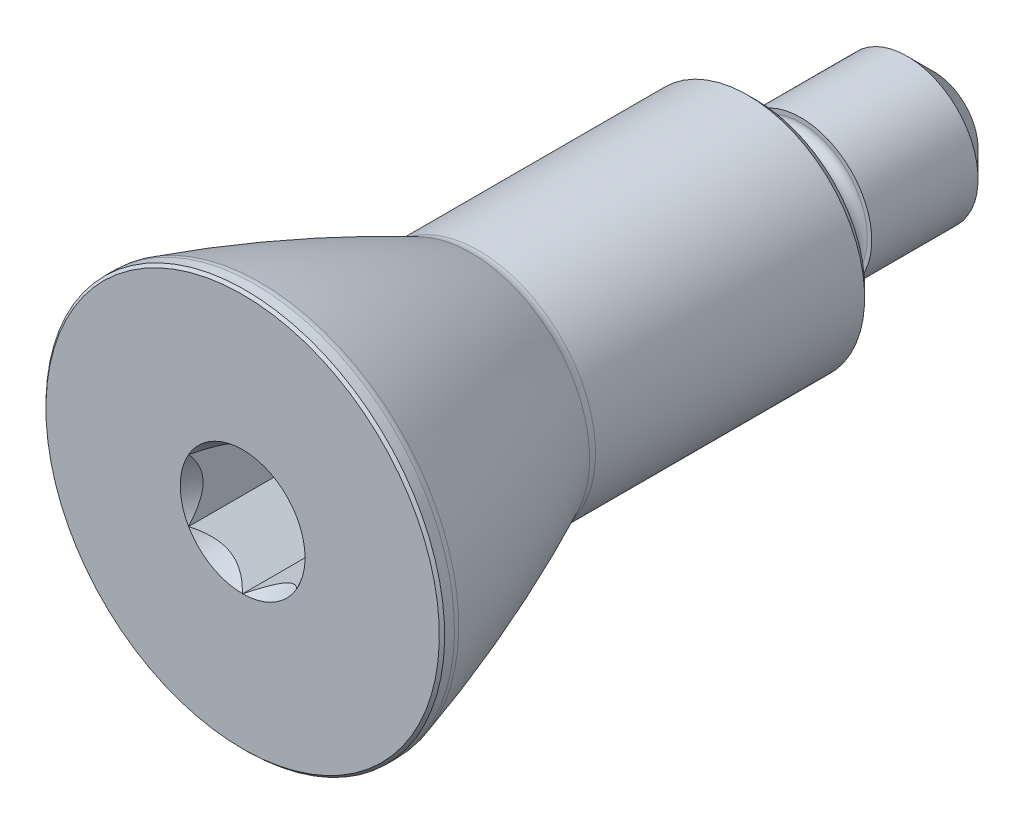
ISO-10303-21;
HEADER;
FILE_DESCRIPTION(('STEP AP214'),'2;1');
FILE_NAME('part.step','',(''),(''),'','','');
FILE_SCHEMA(('AUTOMOTIVE_DESIGN { 1 0 10303 214 1 1 1 1 }'));
ENDSEC;
DATA;
#1=APPLICATION_CONTEXT('core data for automotive mechanical design processes');
#2=APPLICATION_PROTOCOL_DEFINITION('international standard','automotive_design',2000,#1);
#3=PRODUCT_CONTEXT('',#1,'mechanical');
#4=PRODUCT('Part','Part','',(#3));
#5=PRODUCT_RELATED_PRODUCT_CATEGORY('part','',(#4));
#6=PRODUCT_DEFINITION_FORMATION('','',#4);
#7=PRODUCT_DEFINITION_CONTEXT('part definition',#1,'design');
#8=PRODUCT_DEFINITION('design','',#6,#7);
#9=PRODUCT_DEFINITION_SHAPE('','',#8);
#10=(LENGTH_UNIT() NAMED_UNIT(*) SI_UNIT(.MILLI.,.METRE.));
#11=(NAMED_UNIT(*) PLANE_ANGLE_UNIT() SI_UNIT($,.RADIAN.));
#12=(NAMED_UNIT(*) SI_UNIT($,.STERADIAN.) SOLID_ANGLE_UNIT());
#13=UNCERTAINTY_MEASURE_WITH_UNIT(LENGTH_MEASURE(1.E-05),#10,'distance_accuracy_value','');
#14=(GEOMETRIC_REPRESENTATION_CONTEXT(3) GLOBAL_UNCERTAINTY_ASSIGNED_CONTEXT((#13)) GLOBAL_UNIT_ASSIGNED_CONTEXT((#10,
#11,#12)) REPRESENTATION_CONTEXT('',''));
#15=CARTESIAN_POINT('',(0.,0.,0.));
#16=DIRECTION('',(0.,0.,1.));
#17=DIRECTION('',(1.,0.,0.));
#18=AXIS2_PLACEMENT_3D('',#15,#16,#17);
#19=CARTESIAN_POINT('',(0.,0.,29.));
#20=DIRECTION('',(0.,0.,-1.));
#21=DIRECTION('',(-0.5,0.866025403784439,0.));
#22=AXIS2_PLACEMENT_3D('',#19,#20,#21);
#23=PLANE('',#22);
#24=CARTESIAN_POINT('',(0.,0.,29.));
#25=DIRECTION('',(0.,0.,-1.));
#26=DIRECTION('',(-0.5,0.866025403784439,0.));
#27=AXIS2_PLACEMENT_3D('',#24,#25,#26);
#28=CIRCLE('',#27,11.1);
#29=CARTESIAN_POINT('',(-5.55,9.61288198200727,29.));
#30=VERTEX_POINT('',#29);
#31=EDGE_CURVE('E22',#30,#30,#28,.F.);
#32=ORIENTED_EDGE('',*,*,#31,.T.);
#33=EDGE_LOOP('',(#32));
#34=FACE_BOUND('',#33,.T.);
#35=CARTESIAN_POINT('',(0.,0.,29.));
#36=DIRECTION('',(0.,0.,-1.));
#37=DIRECTION('',(-0.5,0.866025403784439,0.));
#38=AXIS2_PLACEMENT_3D('',#35,#36,#37);
#39=CIRCLE('',#38,3.52183664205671);
#40=CARTESIAN_POINT('',(-3.05,1.76091832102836,29.));
#41=VERTEX_POINT('',#40);
#42=CARTESIAN_POINT('',(-3.05,-1.76091832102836,29.));
#43=VERTEX_POINT('',#42);
#44=EDGE_CURVE('E340',#41,#43,#39,.F.);
#45=ORIENTED_EDGE('',*,*,#44,.F.);
#46=CARTESIAN_POINT('',(0.,3.52183664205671,29.));
#47=VERTEX_POINT('',#46);
#48=EDGE_CURVE('E100',#47,#41,#39,.F.);
#49=ORIENTED_EDGE('',*,*,#48,.F.);
#50=CARTESIAN_POINT('',(3.05,1.76091832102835,29.));
#51=VERTEX_POINT('',#50);
#52=EDGE_CURVE('E337',#51,#47,#39,.F.);
#53=ORIENTED_EDGE('',*,*,#52,.F.);
#54=CARTESIAN_POINT('',(3.05,-1.76091832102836,29.));
#55=VERTEX_POINT('',#54);
#56=EDGE_CURVE('E28',#55,#51,#39,.F.);
#57=ORIENTED_EDGE('',*,*,#56,.F.);
#58=CARTESIAN_POINT('',(0.,-3.52183664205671,29.));
#59=VERTEX_POINT('',#58);
#60=EDGE_CURVE('E35',#59,#55,#39,.F.);
#61=ORIENTED_EDGE('',*,*,#60,.F.);
#62=EDGE_CURVE('E348',#43,#59,#39,.F.);
#63=ORIENTED_EDGE('',*,*,#62,.F.);
#64=EDGE_LOOP('',(#45,#49,#53,#57,#61,#63));
#65=FACE_BOUND('',#64,.T.);
#66=ADVANCED_FACE('F14',(#34,#65),#23,.F.);
#67=CARTESIAN_POINT('',(0.,0.,-10.));
#68=DIRECTION('',(0.,0.,1.));
#69=DIRECTION('',(0.5,-0.866025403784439,0.));
#70=AXIS2_PLACEMENT_3D('',#67,#68,#69);
#71=PLANE('',#70);
#72=CARTESIAN_POINT('',(0.,0.,-10.));
#73=DIRECTION('',(0.,0.,1.));
#74=DIRECTION('',(0.5,-0.866025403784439,0.));
#75=AXIS2_PLACEMENT_3D('',#72,#73,#74);
#76=CIRCLE('',#75,2.5);
#77=CARTESIAN_POINT('',(1.25,-2.1650635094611,-10.));
#78=VERTEX_POINT('',#77);
#79=EDGE_CURVE('E162',#78,#78,#76,.F.);
#80=ORIENTED_EDGE('',*,*,#79,.T.);
#81=EDGE_LOOP('',(#80));
#82=FACE_BOUND('',#81,.T.);
#83=ADVANCED_FACE('F243',(#82),#71,.F.);
#84=CARTESIAN_POINT('',(0.,0.,40.2674973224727));
#85=DIRECTION('',(0.,0.,1.));
#86=DIRECTION('',(0.5,-0.866025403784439,0.));
#87=AXIS2_PLACEMENT_3D('',#84,#85,#86);
#88=CYLINDRICAL_SURFACE('',#87,4.);
#89=CARTESIAN_POINT('',(0.,0.,-8.5));
#90=DIRECTION('',(0.,0.,1.));
#91=DIRECTION('',(0.5,-0.866025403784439,0.));
#92=AXIS2_PLACEMENT_3D('',#89,#90,#91);
#93=CIRCLE('',#92,4.);
#94=CARTESIAN_POINT('',(2.,-3.46410161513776,-8.5));
#95=VERTEX_POINT('',#94);
#96=EDGE_CURVE('E159',#95,#95,#93,.T.);
#97=ORIENTED_EDGE('',*,*,#96,.T.);
#98=EDGE_LOOP('',(#97));
#99=FACE_BOUND('',#98,.T.);
#100=CARTESIAN_POINT('',(0.,0.,-2.5));
#101=DIRECTION('',(0.,0.,1.));
#102=DIRECTION('',(0.5,-0.866025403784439,0.));
#103=AXIS2_PLACEMENT_3D('',#100,#101,#102);
#104=CIRCLE('',#103,4.);
#105=CARTESIAN_POINT('',(2.,-3.46410161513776,-2.5));
#106=VERTEX_POINT('',#105);
#107=EDGE_CURVE('E150',#106,#106,#104,.T.);
#108=ORIENTED_EDGE('',*,*,#107,.F.);
#109=EDGE_LOOP('',(#108));
#110=FACE_BOUND('',#109,.T.);
#111=ADVANCED_FACE('F250',(#99,#110),#88,.T.);
#112=CARTESIAN_POINT('',(3.24759526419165,1.875,-2.5));
#113=DIRECTION('',(0.,0.,-1.));
#114=DIRECTION('',(-0.5,0.866025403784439,0.));
#115=AXIS2_PLACEMENT_3D('',#112,#113,#114);
#116=PLANE('',#115);
#117=CARTESIAN_POINT('',(0.,0.,-2.5));
#118=DIRECTION('',(0.,0.,1.));
#119=DIRECTION('',(0.5,-0.866025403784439,0.));
#120=AXIS2_PLACEMENT_3D('',#117,#118,#119);
#121=CIRCLE('',#120,3.75);
#122=CARTESIAN_POINT('',(1.875,-3.24759526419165,-2.5));
#123=VERTEX_POINT('',#122);
#124=EDGE_CURVE('E147',#123,#123,#121,.T.);
#125=ORIENTED_EDGE('',*,*,#124,.F.);
#126=EDGE_LOOP('',(#125));
#127=FACE_BOUND('',#126,.T.);
#128=ORIENTED_EDGE('',*,*,#107,.T.);
#129=EDGE_LOOP('',(#128));
#130=FACE_BOUND('',#129,.T.);
#131=ADVANCED_FACE('F295',(#127,#130),#116,.F.);
#132=CARTESIAN_POINT('',(0.,0.,-2.));
#133=DIRECTION('',(0.,0.,1.));
#134=DIRECTION('',(0.5,-0.866025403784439,0.));
#135=AXIS2_PLACEMENT_3D('',#132,#133,#134);
#136=TOROIDAL_SURFACE('',#135,3.75,0.5);
#137=CARTESIAN_POINT('',(0.,0.,-2.));
#138=DIRECTION('',(0.,0.,1.));
#139=DIRECTION('',(0.5,-0.866025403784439,0.));
#140=AXIS2_PLACEMENT_3D('',#137,#138,#139);
#141=CIRCLE('',#140,3.25);
#142=CARTESIAN_POINT('',(1.625,-2.81458256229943,-2.));
#143=VERTEX_POINT('',#142);
#144=EDGE_CURVE('E144',#143,#143,#141,.T.);
#145=ORIENTED_EDGE('',*,*,#144,.F.);
#146=EDGE_LOOP('',(#145));
#147=FACE_BOUND('',#146,.T.);
#148=ORIENTED_EDGE('',*,*,#124,.T.);
#149=EDGE_LOOP('',(#148));
#150=FACE_BOUND('',#149,.T.);
#151=ADVANCED_FACE('F291',(#147,#150),#136,.F.);
#152=CARTESIAN_POINT('',(0.,0.,40.2674973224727));
#153=DIRECTION('',(0.,0.,1.));
#154=DIRECTION('',(0.5,-0.866025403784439,0.));
#155=AXIS2_PLACEMENT_3D('',#152,#153,#154);
#156=CYLINDRICAL_SURFACE('',#155,3.25);
#157=CARTESIAN_POINT('',(0.,0.,-0.5));
#158=DIRECTION('',(0.,0.,1.));
#159=DIRECTION('',(0.5,-0.866025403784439,0.));
#160=AXIS2_PLACEMENT_3D('',#157,#158,#159);
#161=CIRCLE('',#160,3.25);
#162=CARTESIAN_POINT('',(1.625,-2.81458256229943,-0.5));
#163=VERTEX_POINT('',#162);
#164=EDGE_CURVE('E141',#163,#163,#161,.T.);
#165=ORIENTED_EDGE('',*,*,#164,.F.);
#166=EDGE_LOOP('',(#165));
#167=FACE_BOUND('',#166,.T.);
#168=ORIENTED_EDGE('',*,*,#144,.T.);
#169=EDGE_LOOP('',(#168));
#170=FACE_BOUND('',#169,.T.);
#171=ADVANCED_FACE('F287',(#167,#170),#156,.T.);
#172=CARTESIAN_POINT('',(0.,0.,-0.5));
#173=DIRECTION('',(0.,0.,1.));
#174=DIRECTION('',(0.5,-0.866025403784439,0.));
#175=AXIS2_PLACEMENT_3D('',#172,#173,#174);
#176=TOROIDAL_SURFACE('',#175,3.75,0.5);
#177=CARTESIAN_POINT('',(0.,0.,0.));
#178=DIRECTION('',(0.,0.,1.));
#179=DIRECTION('',(0.5,-0.866025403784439,0.));
#180=AXIS2_PLACEMENT_3D('',#177,#178,#179);
#181=CIRCLE('',#180,3.75);
#182=CARTESIAN_POINT('',(1.875,-3.24759526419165,0.));
#183=VERTEX_POINT('',#182);
#184=EDGE_CURVE('E138',#183,#183,#181,.T.);
#185=ORIENTED_EDGE('',*,*,#184,.F.);
#186=EDGE_LOOP('',(#185));
#187=FACE_BOUND('',#186,.T.);
#188=ORIENTED_EDGE('',*,*,#164,.T.);
#189=EDGE_LOOP('',(#188));
#190=FACE_BOUND('',#189,.T.);
#191=ADVANCED_FACE('F283',(#187,#190),#176,.F.);
#192=CARTESIAN_POINT('',(3.24759526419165,1.875,0.));
#193=DIRECTION('',(0.,0.,1.));
#194=DIRECTION('',(0.5,-0.866025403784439,0.));
#195=AXIS2_PLACEMENT_3D('',#192,#193,#194);
#196=PLANE('',#195);
#197=CARTESIAN_POINT('',(0.,0.,0.));
#198=DIRECTION('',(0.,0.,1.));
#199=DIRECTION('',(0.5,-0.866025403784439,0.));
#200=AXIS2_PLACEMENT_3D('',#197,#198,#199);
#201=CIRCLE('',#200,6.1);
#202=CARTESIAN_POINT('',(3.05,-5.28275496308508,0.));
#203=VERTEX_POINT('',#202);
#204=EDGE_CURVE('E156',#203,#203,#201,.F.);
#205=ORIENTED_EDGE('',*,*,#204,.T.);
#206=EDGE_LOOP('',(#205));
#207=FACE_BOUND('',#206,.T.);
#208=ORIENTED_EDGE('',*,*,#184,.T.);
#209=EDGE_LOOP('',(#208));
#210=FACE_BOUND('',#209,.T.);
#211=ADVANCED_FACE('F279',(#207,#210),#196,.F.);
#212=CARTESIAN_POINT('',(0.,0.,40.2674973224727));
#213=DIRECTION('',(0.,0.,1.));
#214=DIRECTION('',(0.5,-0.866025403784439,0.));
#215=AXIS2_PLACEMENT_3D('',#212,#213,#214);
#216=CYLINDRICAL_SURFACE('',#215,6.6);
#217=CARTESIAN_POINT('',(0.,0.,0.500000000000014));
#218=DIRECTION('',(0.,0.,1.));
#219=DIRECTION('',(0.5,-0.866025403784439,0.));
#220=AXIS2_PLACEMENT_3D('',#217,#218,#219);
#221=CIRCLE('',#220,6.6);
#222=CARTESIAN_POINT('',(3.3,-5.7157676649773,0.500000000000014));
#223=VERTEX_POINT('',#222);
#224=EDGE_CURVE('E153',#223,#223,#221,.T.);
#225=ORIENTED_EDGE('',*,*,#224,.T.);
#226=EDGE_LOOP('',(#225));
#227=FACE_BOUND('',#226,.T.);
#228=CARTESIAN_POINT('',(0.,0.,15.6872780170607));
#229=DIRECTION('',(0.,0.,1.));
#230=DIRECTION('',(0.5,-0.866025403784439,0.));
#231=AXIS2_PLACEMENT_3D('',#228,#229,#230);
#232=CIRCLE('',#231,6.6);
#233=CARTESIAN_POINT('',(3.3,-5.7157676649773,15.6872780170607));
#234=VERTEX_POINT('',#233);
#235=EDGE_CURVE('E135',#234,#234,#232,.T.);
#236=ORIENTED_EDGE('',*,*,#235,.F.);
#237=EDGE_LOOP('',(#236));
#238=FACE_BOUND('',#237,.T.);
#239=ADVANCED_FACE('F275',(#227,#238),#216,.T.);
#240=CARTESIAN_POINT('',(0.,0.,15.6872780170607));
#241=DIRECTION('',(0.,0.,1.));
#242=DIRECTION('',(0.5,-0.866025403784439,0.));
#243=AXIS2_PLACEMENT_3D('',#240,#241,#242);
#244=TOROIDAL_SURFACE('',#243,7.6,1.);
#245=CARTESIAN_POINT('',(0.,0.,16.1139968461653));
#246=DIRECTION('',(0.,0.,1.));
#247=DIRECTION('',(0.5,-0.866025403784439,0.));
#248=AXIS2_PLACEMENT_3D('',#245,#246,#247);
#249=CIRCLE('',#248,6.69561565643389);
#250=CARTESIAN_POINT('',(3.34780782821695,-5.79857325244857,16.1139968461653));
#251=VERTEX_POINT('',#250);
#252=EDGE_CURVE('E132',#251,#251,#249,.T.);
#253=ORIENTED_EDGE('',*,*,#252,.F.);
#254=EDGE_LOOP('',(#253));
#255=FACE_BOUND('',#254,.T.);
#256=ORIENTED_EDGE('',*,*,#235,.T.);
#257=EDGE_LOOP('',(#256));
#258=FACE_BOUND('',#257,.T.);
#259=ADVANCED_FACE('F271',(#255,#258),#244,.F.);
#260=CARTESIAN_POINT('',(0.,0.,50.8062376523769));
#261=DIRECTION('',(0.,0.,1.));
#262=DIRECTION('',(0.5,-0.866025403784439,0.));
#263=AXIS2_PLACEMENT_3D('',#260,#261,#262);
#264=DEGENERATE_TOROIDAL_SURFACE('',#263,66.8308314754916,81.3,.F.);
#265=CARTESIAN_POINT('',(0.,0.,28.0173685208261));
#266=DIRECTION('',(0.,0.,1.));
#267=DIRECTION('',(0.5,-0.866025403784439,0.));
#268=AXIS2_PLACEMENT_3D('',#265,#266,#267);
#269=CIRCLE('',#268,11.2099107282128);
#270=CARTESIAN_POINT('',(5.60495536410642,-9.70806746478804,28.0173685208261));
#271=VERTEX_POINT('',#270);
#272=EDGE_CURVE('E129',#271,#271,#269,.T.);
#273=ORIENTED_EDGE('',*,*,#272,.F.);
#274=EDGE_LOOP('',(#273));
#275=FACE_BOUND('',#274,.T.);
#276=ORIENTED_EDGE('',*,*,#252,.T.);
#277=EDGE_LOOP('',(#276));
#278=FACE_BOUND('',#277,.T.);
#279=ADVANCED_FACE('F267',(#275,#278),#264,.F.);
#280=CARTESIAN_POINT('',(0.,0.,28.297674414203));
#281=DIRECTION('',(0.,0.,1.));
#282=DIRECTION('',(0.5,-0.866025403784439,0.));
#283=AXIS2_PLACEMENT_3D('',#280,#281,#282);
#284=TOROIDAL_SURFACE('',#283,10.25,1.);
#285=CARTESIAN_POINT('',(0.,0.,28.297674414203));
#286=DIRECTION('',(0.,0.,1.));
#287=DIRECTION('',(0.5,-0.866025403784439,0.));
#288=AXIS2_PLACEMENT_3D('',#285,#286,#287);
#289=CIRCLE('',#288,11.25);
#290=CARTESIAN_POINT('',(5.625,-9.74278579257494,28.297674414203));
#291=VERTEX_POINT('',#290);
#292=EDGE_CURVE('E126',#291,#291,#289,.T.);
#293=ORIENTED_EDGE('',*,*,#292,.F.);
#294=EDGE_LOOP('',(#293));
#295=FACE_BOUND('',#294,.T.);
#296=ORIENTED_EDGE('',*,*,#272,.T.);
#297=EDGE_LOOP('',(#296));
#298=FACE_BOUND('',#297,.T.);
#299=ADVANCED_FACE('F263',(#295,#298),#284,.T.);
#300=CARTESIAN_POINT('',(0.,0.,40.2674973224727));
#301=DIRECTION('',(0.,0.,1.));
#302=DIRECTION('',(0.5,-0.866025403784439,0.));
#303=AXIS2_PLACEMENT_3D('',#300,#301,#302);
#304=CYLINDRICAL_SURFACE('',#303,11.25);
#305=CARTESIAN_POINT('',(0.,0.,28.85));
#306=DIRECTION('',(0.,0.,-1.));
#307=DIRECTION('',(-0.5,0.866025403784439,0.));
#308=AXIS2_PLACEMENT_3D('',#305,#306,#307);
#309=CIRCLE('',#308,11.25);
#310=CARTESIAN_POINT('',(-5.625,9.74278579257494,28.85));
#311=VERTEX_POINT('',#310);
#312=EDGE_CURVE('E9',#311,#311,#309,.T.);
#313=ORIENTED_EDGE('',*,*,#312,.T.);
#314=EDGE_LOOP('',(#313));
#315=FACE_BOUND('',#314,.T.);
#316=ORIENTED_EDGE('',*,*,#292,.T.);
#317=EDGE_LOOP('',(#316));
#318=FACE_BOUND('',#317,.T.);
#319=ADVANCED_FACE('F259',(#315,#318),#304,.T.);
#320=CARTESIAN_POINT('',(0.,0.,0.500000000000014));
#321=DIRECTION('',(0.,0.,1.));
#322=DIRECTION('',(0.5,-0.866025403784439,0.));
#323=AXIS2_PLACEMENT_3D('',#320,#321,#322);
#324=CONICAL_SURFACE('',#323,6.6,0.785398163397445);
#325=ORIENTED_EDGE('',*,*,#204,.F.);
#326=EDGE_LOOP('',(#325));
#327=FACE_BOUND('',#326,.T.);
#328=ORIENTED_EDGE('',*,*,#224,.F.);
#329=EDGE_LOOP('',(#328));
#330=FACE_BOUND('',#329,.T.);
#331=ADVANCED_FACE('F262',(#327,#330),#324,.T.);
#332=CARTESIAN_POINT('',(0.,0.,-8.5));
#333=DIRECTION('',(0.,0.,1.));
#334=DIRECTION('',(0.5,-0.866025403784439,0.));
#335=AXIS2_PLACEMENT_3D('',#332,#333,#334);
#336=CONICAL_SURFACE('',#335,4.,0.785398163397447);
#337=ORIENTED_EDGE('',*,*,#79,.F.);
#338=EDGE_LOOP('',(#337));
#339=FACE_BOUND('',#338,.T.);
#340=ORIENTED_EDGE('',*,*,#96,.F.);
#341=EDGE_LOOP('',(#340));
#342=FACE_BOUND('',#341,.T.);
#343=ADVANCED_FACE('F304',(#339,#342),#336,.T.);
#344=CARTESIAN_POINT('',(0.,0.,22.9));
#345=DIRECTION('',(0.,0.,1.));
#346=DIRECTION('',(0.5,-0.866025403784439,0.));
#347=AXIS2_PLACEMENT_3D('',#344,#345,#346);
#348=CONICAL_SURFACE('',#347,0.,0.523598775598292);
#349=ORIENTED_EDGE('',*,*,#48,.T.);
#350=CARTESIAN_POINT('',(-6.04133140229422,0.0338723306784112,33.3640574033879));
#351=CARTESIAN_POINT('',(-5.95843222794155,0.0817341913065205,33.2209537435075));
#352=CARTESIAN_POINT('',(-5.8751417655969,0.129821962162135,33.0781501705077));
#353=CARTESIAN_POINT('',(-5.70761821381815,0.226541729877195,32.7932715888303));
#354=CARTESIAN_POINT('',(-5.62338507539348,0.275173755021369,32.6511966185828));
#355=CARTESIAN_POINT('',(-5.45365369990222,0.37316821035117,32.3676328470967));
#356=CARTESIAN_POINT('',(-5.36815325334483,0.422531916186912,32.226145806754));
#357=CARTESIAN_POINT('',(-5.19584937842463,0.522011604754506,31.9442363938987));
#358=CARTESIAN_POINT('',(-5.10904597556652,0.572127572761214,31.8038140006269));
#359=CARTESIAN_POINT('',(-4.92948368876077,0.675797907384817,31.5172635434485));
#360=CARTESIAN_POINT('',(-4.83664444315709,0.729398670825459,31.3712024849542));
#361=CARTESIAN_POINT('',(-4.64885473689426,0.837819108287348,31.0809024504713));
#362=CARTESIAN_POINT('',(-4.55390433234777,0.892638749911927,30.936663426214));
#363=CARTESIAN_POINT('',(-4.36145849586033,1.00374740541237,30.6506708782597));
#364=CARTESIAN_POINT('',(-4.2639654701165,1.06003503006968,30.5089152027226));
#365=CARTESIAN_POINT('',(-4.06565909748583,1.17452726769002,30.2285458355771));
#366=CARTESIAN_POINT('',(-3.96484616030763,1.23273164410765,30.0899317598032));
#367=CARTESIAN_POINT('',(-3.76697858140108,1.34697054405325,29.8277092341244));
#368=CARTESIAN_POINT('',(-3.67024836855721,1.40281775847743,29.7037760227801));
#369=CARTESIAN_POINT('',(-3.47196380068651,1.51729740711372,29.460908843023));
#370=CARTESIAN_POINT('',(-3.37040541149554,1.5759321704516,29.3419792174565));
#371=CARTESIAN_POINT('',(-3.1623300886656,1.69606451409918,29.1129717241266));
#372=CARTESIAN_POINT('',(-3.05588743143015,1.75751921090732,29.0028046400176));
#373=CARTESIAN_POINT('',(-2.83512425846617,1.88497688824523,28.7936694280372));
#374=CARTESIAN_POINT('',(-2.7208193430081,1.95097086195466,28.6946800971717));
#375=CARTESIAN_POINT('',(-2.54985503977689,2.04967714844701,28.5656668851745));
#376=CARTESIAN_POINT('',(-2.49730800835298,2.08001519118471,28.5283934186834));
#377=CARTESIAN_POINT('',(-2.39005818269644,2.14193590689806,28.4579222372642));
#378=CARTESIAN_POINT('',(-2.33535135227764,2.17352091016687,28.4247326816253));
#379=CARTESIAN_POINT('',(-2.19233592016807,2.2560909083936,28.3461642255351));
#380=CARTESIAN_POINT('',(-2.10246225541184,2.30797949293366,28.3044539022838));
#381=CARTESIAN_POINT('',(-1.91805345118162,2.41444796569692,28.2378736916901));
#382=CARTESIAN_POINT('',(-1.82352428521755,2.46902440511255,28.212982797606));
#383=CARTESIAN_POINT('',(-1.67955559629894,2.55214476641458,28.1909039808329));
#384=CARTESIAN_POINT('',(-1.63094462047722,2.58021032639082,28.1861028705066));
#385=CARTESIAN_POINT('',(-1.53353820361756,2.63644794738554,28.1818877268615));
#386=CARTESIAN_POINT('',(-1.48474276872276,2.66462000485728,28.1824735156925));
#387=CARTESIAN_POINT('',(-1.38745951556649,2.72078651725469,28.1890187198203));
#388=CARTESIAN_POINT('',(-1.33897150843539,2.7487810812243,28.194974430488));
#389=CARTESIAN_POINT('',(-1.24265944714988,2.8043868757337,28.2119798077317));
#390=CARTESIAN_POINT('',(-1.19483581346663,2.83199786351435,28.2230325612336));
#391=CARTESIAN_POINT('',(-1.03489994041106,2.92433688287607,28.2683117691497));
#392=CARTESIAN_POINT('',(-0.925025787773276,2.98777275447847,28.3134819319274));
#393=CARTESIAN_POINT('',(-0.765979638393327,3.07959809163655,28.3955673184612));
#394=CARTESIAN_POINT('',(-0.713817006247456,3.10971420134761,28.4253988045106));
#395=CARTESIAN_POINT('',(-0.611322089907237,3.16888966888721,28.4890323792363));
#396=CARTESIAN_POINT('',(-0.560989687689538,3.19794909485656,28.5228342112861));
#397=CARTESIAN_POINT('',(-0.448434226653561,3.26293302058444,28.6034687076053));
#398=CARTESIAN_POINT('',(-0.386765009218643,3.2985377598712,28.6513224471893));
#399=CARTESIAN_POINT('',(-0.265967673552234,3.36828013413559,28.7511584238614));
#400=CARTESIAN_POINT('',(-0.206840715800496,3.40241709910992,28.8031425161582));
#401=CARTESIAN_POINT('',(-0.0907446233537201,3.46944520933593,28.9104273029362));
#402=CARTESIAN_POINT('',(-0.0337791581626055,3.50233423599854,28.9657332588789));
#403=CARTESIAN_POINT('',(0.0781973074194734,3.56698387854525,29.0789265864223));
#404=CARTESIAN_POINT('',(0.133208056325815,3.59874434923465,29.1368142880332));
#405=CARTESIAN_POINT('',(0.242227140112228,3.66168654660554,29.2554223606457));
#406=CARTESIAN_POINT('',(0.296213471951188,3.69285556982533,29.3161695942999));
#407=CARTESIAN_POINT('',(0.402678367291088,3.75432310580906,29.4393990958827));
#408=CARTESIAN_POINT('',(0.455156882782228,3.78462159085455,29.5018814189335));
#409=CARTESIAN_POINT('',(0.55874466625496,3.84442802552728,29.6282042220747));
#410=CARTESIAN_POINT('',(0.609855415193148,3.87393683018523,29.6920430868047));
#411=CARTESIAN_POINT('',(0.710931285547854,3.93229301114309,29.8209108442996));
#412=CARTESIAN_POINT('',(0.760896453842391,3.96114041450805,29.8859396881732));
#413=CARTESIAN_POINT('',(0.926335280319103,4.0566565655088,30.1050917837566));
#414=CARTESIAN_POINT('',(1.03957532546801,4.12203573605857,30.2614651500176));
#415=CARTESIAN_POINT('',(1.26198259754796,4.25044263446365,30.5780391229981));
#416=CARTESIAN_POINT('',(1.37114904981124,4.31346991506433,30.7382404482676));
#417=CARTESIAN_POINT('',(1.58639535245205,4.43774242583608,31.0615207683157));
#418=CARTESIAN_POINT('',(1.69247342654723,4.49898663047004,31.2246013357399));
#419=CARTESIAN_POINT('',(1.90215907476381,4.62004869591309,31.5528709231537));
#420=CARTESIAN_POINT('',(2.00576653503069,4.67986649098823,31.718060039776));
#421=CARTESIAN_POINT('',(2.21129719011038,4.79852967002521,32.0505476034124));
#422=CARTESIAN_POINT('',(2.31321465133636,4.85737174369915,32.2178507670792));
#423=CARTESIAN_POINT('',(2.51542774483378,4.97411952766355,32.5537602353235));
#424=CARTESIAN_POINT('',(2.61572335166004,5.03202522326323,32.7223665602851));
#425=CARTESIAN_POINT('',(2.91454728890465,5.20455130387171,33.229626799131));
#426=CARTESIAN_POINT('',(3.11108660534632,5.31802333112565,33.5698426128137));
#427=CARTESIAN_POINT('',(3.47743013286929,5.52953186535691,34.2127293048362));
#428=CARTESIAN_POINT('',(3.64764934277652,5.6278079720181,34.5150865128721));
#429=CARTESIAN_POINT('',(3.98588805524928,5.8230901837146,35.1214796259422));
#430=CARTESIAN_POINT('',(4.15390733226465,5.92009615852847,35.4255156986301));
#431=CARTESIAN_POINT('',(4.48730800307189,6.11258512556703,36.0331682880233));
#432=CARTESIAN_POINT('',(4.65269882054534,6.20807355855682,36.3367779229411));
#433=CARTESIAN_POINT('',(4.98208805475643,6.39824652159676,36.9449482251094));
#434=CARTESIAN_POINT('',(5.14608664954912,6.49293115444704,37.2495087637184));
#435=CARTESIAN_POINT('',(5.309564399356,6.58731507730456,37.5544389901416));
#436=B_SPLINE_CURVE_WITH_KNOTS('',3,(#350,#351,#352,#353,#354,#355,#356,#357,#358,#359,#360,
#361,#362,#363,#364,#365,#366,#367,#368,#369,#370,#371,#372,#373,#374,#375,#376,#377,#378,#379,
#380,#381,#382,#383,#384,#385,#386,#387,#388,#389,#390,#391,#392,#393,#394,#395,#396,#397,#398,
#399,#400,#401,#402,#403,#404,#405,#406,#407,#408,#409,#410,#411,#412,#413,#414,#415,#416,#417,
#418,#419,#420,#421,#422,#423,#424,#425,#426,#427,#428,#429,#430,#431,#432,#433,#434,#435),
.UNSPECIFIED.,.F.,.F.,(4,2,2,2,2,2,2,2,2,2,2,2,2,2,2,2,2,2,2,2,2,2,2,2,2,2,2,2,2,2,2,2,2,2,2,2,
2,2,2,2,2,2,4),(0.,0.516504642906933,1.03303625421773,1.55060997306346,2.06817357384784,
2.6116917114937,3.15519542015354,3.69820222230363,4.24114226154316,4.7415416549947,
5.24236676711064,5.73717185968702,6.23102200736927,6.44451918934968,6.65843622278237,
6.99288293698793,7.32691116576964,7.49569251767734,7.66446829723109,7.83312772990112,
8.00188944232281,8.40324541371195,8.60481008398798,8.80636173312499,9.06356118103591,
9.32087681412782,9.57861134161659,9.8363789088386,10.0974628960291,10.3585551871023,
10.619352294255,10.8801387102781,11.4915097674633,12.1029965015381,12.7148282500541,
13.3266881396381,13.9403164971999,14.5539544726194,15.7807872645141,16.8626586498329,
17.9446400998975,19.0206735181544,20.0965671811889),.UNSPECIFIED.);
#437=EDGE_CURVE('E165',#41,#47,#436,.T.);
#438=ORIENTED_EDGE('',*,*,#437,.T.);
#439=EDGE_LOOP('',(#349,#438));
#440=FACE_BOUND('',#439,.T.);
#441=ADVANCED_FACE('F183',(#440),#348,.F.);
#442=ORIENTED_EDGE('',*,*,#44,.T.);
#443=CARTESIAN_POINT('',(-3.05,-1.76114924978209,29.0002000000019));
#444=CARTESIAN_POINT('',(-3.05,-1.68746763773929,28.9364601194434));
#445=CARTESIAN_POINT('',(-3.05,-1.61231240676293,28.8742993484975));
#446=CARTESIAN_POINT('',(-3.05,-1.4581051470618,28.7541573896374));
#447=CARTESIAN_POINT('',(-3.05,-1.3790345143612,28.6962001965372));
#448=CARTESIAN_POINT('',(-3.05,-1.21472357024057,28.584772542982));
#449=CARTESIAN_POINT('',(-3.05,-1.1293766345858,28.5314567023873));
#450=CARTESIAN_POINT('',(-3.05,-0.954102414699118,28.4333386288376));
#451=CARTESIAN_POINT('',(-3.05,-0.86418582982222,28.3885175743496));
#452=CARTESIAN_POINT('',(-3.05,-0.671348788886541,28.3065926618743));
#453=CARTESIAN_POINT('',(-3.05,-0.567979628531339,28.2705112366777));
#454=CARTESIAN_POINT('',(-3.05,-0.357444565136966,28.215892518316));
#455=CARTESIAN_POINT('',(-3.05,-0.250316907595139,28.1972132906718));
#456=CARTESIAN_POINT('',(-3.05,-0.0333983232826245,28.1797183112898));
#457=CARTESIAN_POINT('',(-3.05,0.0764078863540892,28.1810825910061));
#458=CARTESIAN_POINT('',(-3.05,0.294091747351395,28.2038977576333));
#459=CARTESIAN_POINT('',(-3.05,0.401963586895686,28.2254013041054));
#460=CARTESIAN_POINT('',(-3.05,0.643232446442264,28.2939519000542));
#461=CARTESIAN_POINT('',(-3.05,0.774994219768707,28.3465858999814));
#462=CARTESIAN_POINT('',(-3.05,1.02920242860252,28.4713709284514));
#463=CARTESIAN_POINT('',(-3.05,1.15160171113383,28.5436133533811));
#464=CARTESIAN_POINT('',(-3.05,1.35624095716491,28.6798390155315));
#465=CARTESIAN_POINT('',(-3.05,1.44049164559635,28.740894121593));
#466=CARTESIAN_POINT('',(-3.05,1.60405732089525,28.8674854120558));
#467=CARTESIAN_POINT('',(-3.05,1.68341739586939,28.9329630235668));
#468=CARTESIAN_POINT('',(-3.05,1.76114924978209,29.0002000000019));
#469=B_SPLINE_CURVE_WITH_KNOTS('',3,(#443,#444,#445,#446,#447,#448,#449,#450,#451,#452,#453,
#454,#455,#456,#457,#458,#459,#460,#461,#462,#463,#464,#465,#466,#467,#468),.UNSPECIFIED.,.F.,
.F.,(4,2,2,2,2,2,2,2,2,2,2,2,4),(0.,0.292374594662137,0.586304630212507,0.887829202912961,
1.18867768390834,1.51592801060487,1.84048525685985,2.16795945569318,2.49629232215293,
2.91953531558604,3.34478599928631,3.65673008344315,3.96514171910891),.UNSPECIFIED.);
#470=EDGE_CURVE('E190',#43,#41,#469,.T.);
#471=ORIENTED_EDGE('',*,*,#470,.T.);
#472=EDGE_LOOP('',(#442,#471));
#473=FACE_BOUND('',#472,.T.);
#474=ADVANCED_FACE('F312',(#473),#348,.F.);
#475=ORIENTED_EDGE('',*,*,#62,.T.);
#476=CARTESIAN_POINT('',(0.000199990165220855,-3.52195210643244,29.0002));
#477=CARTESIAN_POINT('',(-0.0636101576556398,-3.48511130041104,28.9364601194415));
#478=CARTESIAN_POINT('',(-0.12869649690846,-3.44753368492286,28.8742993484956));
#479=CARTESIAN_POINT('',(-0.262243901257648,-3.37043005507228,28.7541573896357));
#480=CARTESIAN_POINT('',(-0.330721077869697,-3.33089473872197,28.6962001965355));
#481=CARTESIAN_POINT('',(-0.473018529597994,-3.24873926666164,28.5847725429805));
#482=CARTESIAN_POINT('',(-0.546931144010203,-3.20606579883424,28.5314567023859));
#483=CARTESIAN_POINT('',(-0.698723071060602,-3.11842868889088,28.4333386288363));
#484=CARTESIAN_POINT('',(-0.776593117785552,-3.07347039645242,28.3885175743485));
#485=CARTESIAN_POINT('',(-0.943594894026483,-2.97705187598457,28.3065926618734));
#486=CARTESIAN_POINT('',(-1.03311521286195,-2.92536729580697,28.270511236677));
#487=CARTESIAN_POINT('',(-1.21544392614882,-2.8200997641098,28.2158925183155));
#488=CARTESIAN_POINT('',(-1.30821919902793,-2.7665359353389,28.1972132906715));
#489=CARTESIAN_POINT('',(-1.49607620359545,-2.65807664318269,28.1797183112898));
#490=CARTESIAN_POINT('',(-1.59117117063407,-2.60317353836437,28.1810825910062));
#491=CARTESIAN_POINT('',(-1.77969092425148,-2.49433160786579,28.2038977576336));
#492=CARTESIAN_POINT('',(-1.87311067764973,-2.44039568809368,28.2254013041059));
#493=CARTESIAN_POINT('',(-2.08205563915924,-2.31976125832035,28.293951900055));
#494=CARTESIAN_POINT('',(-2.19616468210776,-2.25388037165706,28.3465858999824));
#495=CARTESIAN_POINT('',(-2.4163154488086,-2.12677626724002,28.4713709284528));
#496=CARTESIAN_POINT('',(-2.5223163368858,-2.06557662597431,28.5436133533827));
#497=CARTESIAN_POINT('',(-2.6995391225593,-1.96325700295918,28.6798390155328));
#498=CARTESIAN_POINT('',(-2.7725023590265,-1.9211316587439,28.7408941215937));
#499=CARTESIAN_POINT('',(-2.91415438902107,-1.83934882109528,28.8674854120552));
#500=CARTESIAN_POINT('',(-2.98288222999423,-1.7996687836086,28.9329630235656));
#501=CARTESIAN_POINT('',(-3.05019999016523,-1.76080285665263,29.0002));
#502=B_SPLINE_CURVE_WITH_KNOTS('',3,(#476,#477,#478,#479,#480,#481,#482,#483,#484,#485,#486,
#487,#488,#489,#490,#491,#492,#493,#494,#495,#496,#497,#498,#499,#500,#501),.UNSPECIFIED.,.F.,
.F.,(4,2,2,2,2,2,2,2,2,2,2,2,4),(0.,0.292374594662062,0.586304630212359,0.887829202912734,
1.18867768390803,1.51592801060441,1.84048525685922,2.16795945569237,2.49629232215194,
2.9195353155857,3.34478599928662,3.65673008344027,3.96514171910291),.UNSPECIFIED.);
#503=EDGE_CURVE('E197',#59,#43,#502,.T.);
#504=ORIENTED_EDGE('',*,*,#503,.T.);
#505=EDGE_LOOP('',(#475,#504));
#506=FACE_BOUND('',#505,.T.);
#507=ADVANCED_FACE('F324',(#506),#348,.F.);
#508=ORIENTED_EDGE('',*,*,#60,.T.);
#509=CARTESIAN_POINT('',(-2.99133140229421,-5.24888263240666,33.3640574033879));
#510=CARTESIAN_POINT('',(-2.90843222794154,-5.20102077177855,33.2209537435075));
#511=CARTESIAN_POINT('',(-2.82514176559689,-5.15293300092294,33.0781501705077));
#512=CARTESIAN_POINT('',(-2.65761821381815,-5.05621323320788,32.7932715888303));
#513=CARTESIAN_POINT('',(-2.57338507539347,-5.00758120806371,32.6511966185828));
#514=CARTESIAN_POINT('',(-2.40365369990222,-4.9095867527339,32.3676328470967));
#515=CARTESIAN_POINT('',(-2.31815325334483,-4.86022304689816,32.226145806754));
#516=CARTESIAN_POINT('',(-2.14584937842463,-4.76074335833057,31.9442363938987));
#517=CARTESIAN_POINT('',(-2.05904597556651,-4.71062739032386,31.8038140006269));
#518=CARTESIAN_POINT('',(-1.87948368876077,-4.60695705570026,31.5172635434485));
#519=CARTESIAN_POINT('',(-1.78664444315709,-4.55335629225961,31.3712024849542));
#520=CARTESIAN_POINT('',(-1.59885473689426,-4.44493585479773,31.0809024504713));
#521=CARTESIAN_POINT('',(-1.50390433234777,-4.39011621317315,30.936663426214));
#522=CARTESIAN_POINT('',(-1.31145849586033,-4.2790075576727,30.6506708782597));
#523=CARTESIAN_POINT('',(-1.2139654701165,-4.22271993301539,30.5089152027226));
#524=CARTESIAN_POINT('',(-1.01565909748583,-4.10822769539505,30.2285458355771));
#525=CARTESIAN_POINT('',(-0.914846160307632,-4.05002331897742,30.0899317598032));
#526=CARTESIAN_POINT('',(-0.71697858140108,-3.93578441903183,29.8277092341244));
#527=CARTESIAN_POINT('',(-0.620248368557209,-3.87993720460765,29.7037760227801));
#528=CARTESIAN_POINT('',(-0.421963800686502,-3.76545755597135,29.460908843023));
#529=CARTESIAN_POINT('',(-0.320405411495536,-3.70682279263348,29.3419792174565));
#530=CARTESIAN_POINT('',(-0.112330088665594,-3.5866904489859,29.1129717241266));
#531=CARTESIAN_POINT('',(-0.00588743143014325,-3.52523575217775,29.0028046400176));
#532=CARTESIAN_POINT('',(0.214875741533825,-3.39777807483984,28.7936694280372));
#533=CARTESIAN_POINT('',(0.329180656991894,-3.33178410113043,28.6946800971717));
#534=CARTESIAN_POINT('',(0.500144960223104,-3.23307781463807,28.5656668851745));
#535=CARTESIAN_POINT('',(0.552691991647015,-3.20273977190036,28.5283934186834));
#536=CARTESIAN_POINT('',(0.659941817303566,-3.14081905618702,28.4579222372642));
#537=CARTESIAN_POINT('',(0.714648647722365,-3.10923405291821,28.4247326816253));
#538=CARTESIAN_POINT('',(0.857664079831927,-3.02666405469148,28.3461642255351));
#539=CARTESIAN_POINT('',(0.94753774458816,-2.97477547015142,28.3044539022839));
#540=CARTESIAN_POINT('',(1.13194654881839,-2.86830699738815,28.2378736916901));
#541=CARTESIAN_POINT('',(1.22647571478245,-2.81373055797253,28.212982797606));
#542=CARTESIAN_POINT('',(1.37044440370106,-2.73061019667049,28.1909039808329));
#543=CARTESIAN_POINT('',(1.41905537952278,-2.70254463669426,28.1861028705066));
#544=CARTESIAN_POINT('',(1.51646179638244,-2.64630701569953,28.1818877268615));
#545=CARTESIAN_POINT('',(1.56525723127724,-2.6181349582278,28.1824735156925));
#546=CARTESIAN_POINT('',(1.66254048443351,-2.56196844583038,28.1890187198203));
#547=CARTESIAN_POINT('',(1.71102849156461,-2.53397388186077,28.194974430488));
#548=CARTESIAN_POINT('',(1.80734055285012,-2.47836808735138,28.2119798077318));
#549=CARTESIAN_POINT('',(1.85516418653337,-2.45075709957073,28.2230325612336));
#550=CARTESIAN_POINT('',(2.01510005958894,-2.35841808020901,28.2683117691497));
#551=CARTESIAN_POINT('',(2.12497421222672,-2.29498220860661,28.3134819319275));
#552=CARTESIAN_POINT('',(2.28402036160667,-2.20315687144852,28.3955673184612));
#553=CARTESIAN_POINT('',(2.33618299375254,-2.17304076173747,28.4253988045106));
#554=CARTESIAN_POINT('',(2.43867791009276,-2.11386529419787,28.4890323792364));
#555=CARTESIAN_POINT('',(2.48901031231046,-2.08480586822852,28.5228342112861));
#556=CARTESIAN_POINT('',(2.60156577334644,-2.01982194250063,28.6034687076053));
#557=CARTESIAN_POINT('',(2.66323499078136,-1.98421720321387,28.6513224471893));
#558=CARTESIAN_POINT('',(2.78403232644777,-1.91447482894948,28.7511584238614));
#559=CARTESIAN_POINT('',(2.8431592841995,-1.88033786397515,28.8031425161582));
#560=CARTESIAN_POINT('',(2.95925537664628,-1.81330975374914,28.9104273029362));
#561=CARTESIAN_POINT('',(3.0162208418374,-1.78042072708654,28.9657332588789));
#562=CARTESIAN_POINT('',(3.12819730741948,-1.71577108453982,29.0789265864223));
#563=CARTESIAN_POINT('',(3.18320805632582,-1.68401061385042,29.1368142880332));
#564=CARTESIAN_POINT('',(3.29222714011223,-1.62106841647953,29.2554223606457));
#565=CARTESIAN_POINT('',(3.34621347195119,-1.58989939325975,29.3161695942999));
#566=CARTESIAN_POINT('',(3.45267836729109,-1.52843185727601,29.4393990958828));
#567=CARTESIAN_POINT('',(3.50515688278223,-1.49813337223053,29.5018814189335));
#568=CARTESIAN_POINT('',(3.60874466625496,-1.43832693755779,29.6282042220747));
#569=CARTESIAN_POINT('',(3.65985541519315,-1.40881813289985,29.6920430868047));
#570=CARTESIAN_POINT('',(3.76093128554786,-1.35046195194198,29.8209108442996));
#571=CARTESIAN_POINT('',(3.8108964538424,-1.32161454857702,29.8859396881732));
#572=CARTESIAN_POINT('',(3.97633528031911,-1.22609839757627,30.1050917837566));
#573=CARTESIAN_POINT('',(4.08957532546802,-1.16071922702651,30.2614651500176));
#574=CARTESIAN_POINT('',(4.31198259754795,-1.03231232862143,30.5780391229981));
#575=CARTESIAN_POINT('',(4.42114904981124,-0.969285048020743,30.7382404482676));
#576=CARTESIAN_POINT('',(4.63639535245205,-0.845012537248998,31.0615207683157));
#577=CARTESIAN_POINT('',(4.74247342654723,-0.783768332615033,31.2246013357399));
#578=CARTESIAN_POINT('',(4.95215907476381,-0.662706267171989,31.5528709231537));
#579=CARTESIAN_POINT('',(5.0557665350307,-0.602888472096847,31.718060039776));
#580=CARTESIAN_POINT('',(5.26129719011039,-0.484225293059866,32.0505476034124));
#581=CARTESIAN_POINT('',(5.36321465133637,-0.425383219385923,32.2178507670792));
#582=CARTESIAN_POINT('',(5.56542774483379,-0.308635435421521,32.5537602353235));
#583=CARTESIAN_POINT('',(5.66572335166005,-0.250729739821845,32.7223665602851));
#584=CARTESIAN_POINT('',(5.96454728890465,-0.0782036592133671,33.229626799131));
#585=CARTESIAN_POINT('',(6.16108660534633,0.0352683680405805,33.5698426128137));
#586=CARTESIAN_POINT('',(6.5274301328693,0.246776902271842,34.2127293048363));
#587=CARTESIAN_POINT('',(6.69764934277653,0.345053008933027,34.5150865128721));
#588=CARTESIAN_POINT('',(7.03588805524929,0.540335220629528,35.1214796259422));
#589=CARTESIAN_POINT('',(7.20390733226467,0.637341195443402,35.4255156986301));
#590=CARTESIAN_POINT('',(7.53730800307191,0.829830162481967,36.0331682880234));
#591=CARTESIAN_POINT('',(7.70269882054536,0.925318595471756,36.3367779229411));
#592=CARTESIAN_POINT('',(8.03208805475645,1.11549155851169,36.9449482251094));
#593=CARTESIAN_POINT('',(8.19608664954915,1.21017619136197,37.2495087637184));
#594=CARTESIAN_POINT('',(8.35956439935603,1.30456011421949,37.5544389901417));
#595=B_SPLINE_CURVE_WITH_KNOTS('',3,(#509,#510,#511,#512,#513,#514,#515,#516,#517,#518,#519,
#520,#521,#522,#523,#524,#525,#526,#527,#528,#529,#530,#531,#532,#533,#534,#535,#536,#537,#538,
#539,#540,#541,#542,#543,#544,#545,#546,#547,#548,#549,#550,#551,#552,#553,#554,#555,#556,#557,
#558,#559,#560,#561,#562,#563,#564,#565,#566,#567,#568,#569,#570,#571,#572,#573,#574,#575,#576,
#577,#578,#579,#580,#581,#582,#583,#584,#585,#586,#587,#588,#589,#590,#591,#592,#593,#594),
.UNSPECIFIED.,.F.,.F.,(4,2,2,2,2,2,2,2,2,2,2,2,2,2,2,2,2,2,2,2,2,2,2,2,2,2,2,2,2,2,2,2,2,2,2,2,
2,2,2,2,2,2,4),(0.,0.516504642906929,1.03303625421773,1.55060997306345,2.06817357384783,
2.6116917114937,3.15519542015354,3.69820222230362,4.24114226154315,4.7415416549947,
5.24236676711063,5.73717185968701,6.23102200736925,6.44451918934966,6.65843622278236,
6.99288293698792,7.32691116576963,7.49569251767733,7.66446829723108,7.83312772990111,
8.0018894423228,8.40324541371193,8.60481008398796,8.80636173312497,9.0635611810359,
9.32087681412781,9.57861134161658,9.8363789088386,10.097462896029,10.3585551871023,
10.619352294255,10.8801387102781,11.4915097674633,12.1029965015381,12.7148282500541,
13.3266881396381,13.9403164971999,14.5539544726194,15.7807872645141,16.8626586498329,
17.9446400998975,19.0206735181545,20.0965671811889),.UNSPECIFIED.);
#596=EDGE_CURVE('E204',#55,#59,#595,.F.);
#597=ORIENTED_EDGE('',*,*,#596,.T.);
#598=EDGE_LOOP('',(#508,#597));
#599=FACE_BOUND('',#598,.T.);
#600=ADVANCED_FACE('F182',(#599),#348,.F.);
#601=ORIENTED_EDGE('',*,*,#56,.T.);
#602=CARTESIAN_POINT('',(3.05,1.76114924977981,29.0002));
#603=CARTESIAN_POINT('',(3.05,1.687467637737,28.9364601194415));
#604=CARTESIAN_POINT('',(3.05,1.61231240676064,28.8742993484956));
#605=CARTESIAN_POINT('',(3.05,1.45810514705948,28.7541573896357));
#606=CARTESIAN_POINT('',(3.05,1.37903451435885,28.6962001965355));
#607=CARTESIAN_POINT('',(3.05,1.21472357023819,28.5847725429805));
#608=CARTESIAN_POINT('',(3.05,1.1293766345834,28.5314567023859));
#609=CARTESIAN_POINT('',(3.05,0.954102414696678,28.4333386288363));
#610=CARTESIAN_POINT('',(3.05,0.86418582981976,28.3885175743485));
#611=CARTESIAN_POINT('',(3.05,0.671348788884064,28.3065926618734));
#612=CARTESIAN_POINT('',(3.05,0.567979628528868,28.270511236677));
#613=CARTESIAN_POINT('',(3.05,0.357444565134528,28.2158925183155));
#614=CARTESIAN_POINT('',(3.05,0.250316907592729,28.1972132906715));
#615=CARTESIAN_POINT('',(3.05,0.0333983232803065,28.1797183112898));
#616=CARTESIAN_POINT('',(3.05,-0.0764078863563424,28.1810825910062));
#617=CARTESIAN_POINT('',(3.05,-0.2940917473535,28.2038977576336));
#618=CARTESIAN_POINT('',(3.05,-0.401963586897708,28.2254013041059));
#619=CARTESIAN_POINT('',(3.05,-0.643232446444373,28.293951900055));
#620=CARTESIAN_POINT('',(3.05,-0.774994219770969,28.3465858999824));
#621=CARTESIAN_POINT('',(3.05,-1.02920242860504,28.4713709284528));
#622=CARTESIAN_POINT('',(3.05,-1.15160171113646,28.5436133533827));
#623=CARTESIAN_POINT('',(3.05,-1.35624095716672,28.6798390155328));
#624=CARTESIAN_POINT('',(3.05,-1.44049164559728,28.7408941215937));
#625=CARTESIAN_POINT('',(3.05,-1.60405732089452,28.8674854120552));
#626=CARTESIAN_POINT('',(3.05,-1.68341739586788,28.9329630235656));
#627=CARTESIAN_POINT('',(3.05,-1.76114924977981,29.0002));
#628=B_SPLINE_CURVE_WITH_KNOTS('',3,(#602,#603,#604,#605,#606,#607,#608,#609,#610,#611,#612,
#613,#614,#615,#616,#617,#618,#619,#620,#621,#622,#623,#624,#625,#626,#627),.UNSPECIFIED.,.F.,
.F.,(4,2,2,2,2,2,2,2,2,2,2,2,4),(0.,0.292374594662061,0.586304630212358,0.887829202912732,
1.18867768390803,1.51592801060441,1.84048525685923,2.16795945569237,2.49629232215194,
2.91953531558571,3.34478599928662,3.65673008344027,3.96514171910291),.UNSPECIFIED.);
#629=EDGE_CURVE('E211',#51,#55,#628,.T.);
#630=ORIENTED_EDGE('',*,*,#629,.T.);
#631=EDGE_LOOP('',(#601,#630));
#632=FACE_BOUND('',#631,.T.);
#633=ADVANCED_FACE('F177',(#632),#348,.F.);
#634=ORIENTED_EDGE('',*,*,#52,.T.);
#635=CARTESIAN_POINT('',(-0.000199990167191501,3.52195210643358,29.0002000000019));
#636=CARTESIAN_POINT('',(0.0636101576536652,3.48511130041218,28.9364601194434));
#637=CARTESIAN_POINT('',(0.128696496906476,3.447533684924,28.8742993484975));
#638=CARTESIAN_POINT('',(0.26224390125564,3.37043005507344,28.7541573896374));
#639=CARTESIAN_POINT('',(0.330721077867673,3.33089473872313,28.6962001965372));
#640=CARTESIAN_POINT('',(0.473018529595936,3.24873926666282,28.584772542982));
#641=CARTESIAN_POINT('',(0.546931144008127,3.20606579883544,28.5314567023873));
#642=CARTESIAN_POINT('',(0.698723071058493,3.1184286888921,28.4333386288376));
#643=CARTESIAN_POINT('',(0.776593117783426,3.07347039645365,28.3885175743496));
#644=CARTESIAN_POINT('',(0.943594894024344,2.97705187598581,28.3065926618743));
#645=CARTESIAN_POINT('',(1.03311521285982,2.92536729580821,28.2705112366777));
#646=CARTESIAN_POINT('',(1.21544392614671,2.82009976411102,28.215892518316));
#647=CARTESIAN_POINT('',(1.30821919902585,2.76653593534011,28.1972132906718));
#648=CARTESIAN_POINT('',(1.49607620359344,2.65807664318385,28.1797183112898));
#649=CARTESIAN_POINT('',(1.59117117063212,2.60317353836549,28.1810825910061));
#650=CARTESIAN_POINT('',(1.77969092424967,2.49433160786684,28.2038977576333));
#651=CARTESIAN_POINT('',(1.87311067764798,2.44039568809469,28.2254013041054));
#652=CARTESIAN_POINT('',(2.08205563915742,2.3197612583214,28.2939519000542));
#653=CARTESIAN_POINT('',(2.1961646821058,2.25388037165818,28.3465858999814));
#654=CARTESIAN_POINT('',(2.41631544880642,2.12677626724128,28.4713709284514));
#655=CARTESIAN_POINT('',(2.52231633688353,2.06557662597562,28.5436133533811));
#656=CARTESIAN_POINT('',(2.69953912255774,1.96325700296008,28.6798390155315));
#657=CARTESIAN_POINT('',(2.77250235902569,1.92113165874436,28.740894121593));
#658=CARTESIAN_POINT('',(2.91415438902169,1.83934882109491,28.8674854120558));
#659=CARTESIAN_POINT('',(2.98288222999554,1.79966878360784,28.9329630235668));
#660=CARTESIAN_POINT('',(3.05019999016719,1.76080285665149,29.0002000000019));
#661=B_SPLINE_CURVE_WITH_KNOTS('',3,(#635,#636,#637,#638,#639,#640,#641,#642,#643,#644,#645,
#646,#647,#648,#649,#650,#651,#652,#653,#654,#655,#656,#657,#658,#659,#660),.UNSPECIFIED.,.F.,
.F.,(4,2,2,2,2,2,2,2,2,2,2,2,4),(0.,0.292374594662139,0.586304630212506,0.88782920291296,
1.18867768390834,1.51592801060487,1.84048525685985,2.16795945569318,2.49629232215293,
2.91953531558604,3.34478599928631,3.65673008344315,3.9651417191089),.UNSPECIFIED.);
#662=EDGE_CURVE('E78',#47,#51,#661,.T.);
#663=ORIENTED_EDGE('',*,*,#662,.T.);
#664=EDGE_LOOP('',(#634,#663));
#665=FACE_BOUND('',#664,.T.);
#666=ADVANCED_FACE('F181',(#665),#348,.F.);
#667=CARTESIAN_POINT('',(0.,0.,23.));
#668=DIRECTION('',(0.,0.,1.));
#669=DIRECTION('',(0.5,-0.866025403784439,0.));
#670=AXIS2_PLACEMENT_3D('',#667,#668,#669);
#671=CONICAL_SURFACE('',#670,2.5,1.02974425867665);
#672=CARTESIAN_POINT('',(0.,0.,21.4978484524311));
#673=VERTEX_POINT('',#672);
#674=VERTEX_LOOP('',#673);
#675=FACE_BOUND('',#674,.T.);
#676=CARTESIAN_POINT('',(0.,0.,23.));
#677=DIRECTION('',(0.,0.,1.));
#678=DIRECTION('',(0.5,-0.866025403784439,0.));
#679=AXIS2_PLACEMENT_3D('',#676,#677,#678);
#680=CIRCLE('',#679,2.5);
#681=CARTESIAN_POINT('',(1.25,-2.1650635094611,23.));
#682=VERTEX_POINT('',#681);
#683=EDGE_CURVE('E123',#682,#682,#680,.T.);
#684=ORIENTED_EDGE('',*,*,#683,.T.);
#685=EDGE_LOOP('',(#684));
#686=FACE_BOUND('',#685,.T.);
#687=ADVANCED_FACE('F257',(#675,#686),#671,.F.);
#688=CARTESIAN_POINT('',(0.,0.,29.));
#689=DIRECTION('',(0.,0.,1.));
#690=DIRECTION('',(0.5,-0.866025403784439,0.));
#691=AXIS2_PLACEMENT_3D('',#688,#689,#690);
#692=CYLINDRICAL_SURFACE('',#691,2.5);
#693=ORIENTED_EDGE('',*,*,#683,.F.);
#694=EDGE_LOOP('',(#693));
#695=FACE_BOUND('',#694,.T.);
#696=CARTESIAN_POINT('',(0.,0.,24.));
#697=DIRECTION('',(0.,0.,1.));
#698=DIRECTION('',(0.5,-0.866025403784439,0.));
#699=AXIS2_PLACEMENT_3D('',#696,#697,#698);
#700=CIRCLE('',#699,2.5);
#701=CARTESIAN_POINT('',(1.25,-2.1650635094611,24.));
#702=VERTEX_POINT('',#701);
#703=EDGE_CURVE('E112',#702,#702,#700,.F.);
#704=ORIENTED_EDGE('',*,*,#703,.F.);
#705=EDGE_LOOP('',(#704));
#706=FACE_BOUND('',#705,.T.);
#707=ADVANCED_FACE('F333',(#695,#706),#692,.F.);
#708=CARTESIAN_POINT('',(0.,3.52183664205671,24.));
#709=DIRECTION('',(0.,0.,1.));
#710=DIRECTION('',(0.5,-0.866025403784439,0.));
#711=AXIS2_PLACEMENT_3D('',#708,#709,#710);
#712=PLANE('',#711);
#713=DIRECTION('',(-0.866025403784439,0.5,0.));
#714=VECTOR('',#713,1.);
#715=CARTESIAN_POINT('',(3.05,1.76091832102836,24.));
#716=LINE('',#715,#714);
#717=CARTESIAN_POINT('',(3.05,1.76091832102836,24.));
#718=VERTEX_POINT('',#717);
#719=CARTESIAN_POINT('',(0.,3.52183664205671,24.));
#720=VERTEX_POINT('',#719);
#721=EDGE_CURVE('E76',#718,#720,#716,.T.);
#722=ORIENTED_EDGE('',*,*,#721,.T.);
#723=DIRECTION('',(-0.866025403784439,-0.5,0.));
#724=VECTOR('',#723,1.);
#725=CARTESIAN_POINT('',(0.,3.52183664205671,24.));
#726=LINE('',#725,#724);
#727=CARTESIAN_POINT('',(-3.05,1.76091832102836,24.));
#728=VERTEX_POINT('',#727);
#729=EDGE_CURVE('E86',#720,#728,#726,.T.);
#730=ORIENTED_EDGE('',*,*,#729,.T.);
#731=DIRECTION('',(0.,-1.,0.));
#732=VECTOR('',#731,1.);
#733=CARTESIAN_POINT('',(-3.05,1.76091832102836,24.));
#734=LINE('',#733,#732);
#735=CARTESIAN_POINT('',(-3.05,-1.76091832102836,24.));
#736=VERTEX_POINT('',#735);
#737=EDGE_CURVE('E92',#728,#736,#734,.T.);
#738=ORIENTED_EDGE('',*,*,#737,.T.);
#739=DIRECTION('',(0.866025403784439,-0.5,0.));
#740=VECTOR('',#739,1.);
#741=CARTESIAN_POINT('',(-3.05,-1.76091832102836,24.));
#742=LINE('',#741,#740);
#743=CARTESIAN_POINT('',(0.,-3.52183664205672,24.));
#744=VERTEX_POINT('',#743);
#745=EDGE_CURVE('E104',#736,#744,#742,.T.);
#746=ORIENTED_EDGE('',*,*,#745,.T.);
#747=DIRECTION('',(0.866025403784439,0.5,0.));
#748=VECTOR('',#747,1.);
#749=CARTESIAN_POINT('',(0.,-3.52183664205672,24.));
#750=LINE('',#749,#748);
#751=CARTESIAN_POINT('',(3.05,-1.76091832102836,24.));
#752=VERTEX_POINT('',#751);
#753=EDGE_CURVE('E107',#744,#752,#750,.T.);
#754=ORIENTED_EDGE('',*,*,#753,.T.);
#755=DIRECTION('',(0.,1.,0.));
#756=VECTOR('',#755,1.);
#757=CARTESIAN_POINT('',(3.05,-1.76091832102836,24.));
#758=LINE('',#757,#756);
#759=EDGE_CURVE('E83',#752,#718,#758,.T.);
#760=ORIENTED_EDGE('',*,*,#759,.T.);
#761=EDGE_LOOP('',(#722,#730,#738,#746,#754,#760));
#762=FACE_BOUND('',#761,.T.);
#763=ORIENTED_EDGE('',*,*,#703,.T.);
#764=EDGE_LOOP('',(#763));
#765=FACE_BOUND('',#764,.T.);
#766=ADVANCED_FACE('F94',(#762,#765),#712,.T.);
#767=CARTESIAN_POINT('',(0.,3.52183664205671,24.));
#768=DIRECTION('',(-0.5,0.866025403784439,0.));
#769=DIRECTION('',(-0.866025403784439,-0.5,0.));
#770=AXIS2_PLACEMENT_3D('',#767,#768,#769);
#771=PLANE('',#770);
#772=ORIENTED_EDGE('',*,*,#437,.F.);
#773=DIRECTION('',(0.,0.,1.));
#774=VECTOR('',#773,1.);
#775=CARTESIAN_POINT('',(-3.05,1.76091832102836,24.));
#776=LINE('',#775,#774);
#777=EDGE_CURVE('E82',#728,#41,#776,.T.);
#778=ORIENTED_EDGE('',*,*,#777,.F.);
#779=ORIENTED_EDGE('',*,*,#729,.F.);
#780=DIRECTION('',(0.,0.,1.));
#781=VECTOR('',#780,1.);
#782=CARTESIAN_POINT('',(0.,3.52183664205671,24.));
#783=LINE('',#782,#781);
#784=EDGE_CURVE('E71',#720,#47,#783,.T.);
#785=ORIENTED_EDGE('',*,*,#784,.T.);
#786=EDGE_LOOP('',(#772,#778,#779,#785));
#787=FACE_BOUND('',#786,.T.);
#788=ADVANCED_FACE('F87',(#787),#771,.F.);
#789=CARTESIAN_POINT('',(-3.05,1.76091832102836,24.));
#790=DIRECTION('',(-1.,0.,0.));
#791=DIRECTION('',(0.,-1.,0.));
#792=AXIS2_PLACEMENT_3D('',#789,#790,#791);
#793=PLANE('',#792);
#794=ORIENTED_EDGE('',*,*,#470,.F.);
#795=DIRECTION('',(0.,0.,1.));
#796=VECTOR('',#795,1.);
#797=CARTESIAN_POINT('',(-3.05,-1.76091832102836,24.));
#798=LINE('',#797,#796);
#799=EDGE_CURVE('E119',#736,#43,#798,.T.);
#800=ORIENTED_EDGE('',*,*,#799,.F.);
#801=ORIENTED_EDGE('',*,*,#737,.F.);
#802=ORIENTED_EDGE('',*,*,#777,.T.);
#803=EDGE_LOOP('',(#794,#800,#801,#802));
#804=FACE_BOUND('',#803,.T.);
#805=ADVANCED_FACE('F231',(#804),#793,.F.);
#806=CARTESIAN_POINT('',(-3.05,-1.76091832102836,24.));
#807=DIRECTION('',(-0.5,-0.866025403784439,0.));
#808=DIRECTION('',(0.866025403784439,-0.5,0.));
#809=AXIS2_PLACEMENT_3D('',#806,#807,#808);
#810=PLANE('',#809);
#811=ORIENTED_EDGE('',*,*,#503,.F.);
#812=DIRECTION('',(0.,0.,1.));
#813=VECTOR('',#812,1.);
#814=CARTESIAN_POINT('',(0.,-3.52183664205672,24.));
#815=LINE('',#814,#813);
#816=EDGE_CURVE('E116',#744,#59,#815,.T.);
#817=ORIENTED_EDGE('',*,*,#816,.F.);
#818=ORIENTED_EDGE('',*,*,#745,.F.);
#819=ORIENTED_EDGE('',*,*,#799,.T.);
#820=EDGE_LOOP('',(#811,#817,#818,#819));
#821=FACE_BOUND('',#820,.T.);
#822=ADVANCED_FACE('F227',(#821),#810,.F.);
#823=CARTESIAN_POINT('',(0.,-3.52183664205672,24.));
#824=DIRECTION('',(0.5,-0.866025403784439,0.));
#825=DIRECTION('',(0.866025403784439,0.5,0.));
#826=AXIS2_PLACEMENT_3D('',#823,#824,#825);
#827=PLANE('',#826);
#828=ORIENTED_EDGE('',*,*,#596,.F.);
#829=DIRECTION('',(0.,0.,1.));
#830=VECTOR('',#829,1.);
#831=CARTESIAN_POINT('',(3.05,-1.76091832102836,24.));
#832=LINE('',#831,#830);
#833=EDGE_CURVE('E113',#752,#55,#832,.T.);
#834=ORIENTED_EDGE('',*,*,#833,.F.);
#835=ORIENTED_EDGE('',*,*,#753,.F.);
#836=ORIENTED_EDGE('',*,*,#816,.T.);
#837=EDGE_LOOP('',(#828,#834,#835,#836));
#838=FACE_BOUND('',#837,.T.);
#839=ADVANCED_FACE('F223',(#838),#827,.F.);
#840=CARTESIAN_POINT('',(3.05,-1.76091832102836,24.));
#841=DIRECTION('',(1.,0.,0.));
#842=DIRECTION('',(0.,1.,0.));
#843=AXIS2_PLACEMENT_3D('',#840,#841,#842);
#844=PLANE('',#843);
#845=ORIENTED_EDGE('',*,*,#629,.F.);
#846=DIRECTION('',(0.,0.,1.));
#847=VECTOR('',#846,1.);
#848=CARTESIAN_POINT('',(3.05,1.76091832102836,24.));
#849=LINE('',#848,#847);
#850=EDGE_CURVE('E110',#718,#51,#849,.T.);
#851=ORIENTED_EDGE('',*,*,#850,.F.);
#852=ORIENTED_EDGE('',*,*,#759,.F.);
#853=ORIENTED_EDGE('',*,*,#833,.T.);
#854=EDGE_LOOP('',(#845,#851,#852,#853));
#855=FACE_BOUND('',#854,.T.);
#856=ADVANCED_FACE('F220',(#855),#844,.F.);
#857=CARTESIAN_POINT('',(3.05,1.76091832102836,24.));
#858=DIRECTION('',(0.5,0.866025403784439,0.));
#859=DIRECTION('',(-0.866025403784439,0.5,0.));
#860=AXIS2_PLACEMENT_3D('',#857,#858,#859);
#861=PLANE('',#860);
#862=ORIENTED_EDGE('',*,*,#662,.F.);
#863=ORIENTED_EDGE('',*,*,#784,.F.);
#864=ORIENTED_EDGE('',*,*,#721,.F.);
#865=ORIENTED_EDGE('',*,*,#850,.T.);
#866=EDGE_LOOP('',(#862,#863,#864,#865));
#867=FACE_BOUND('',#866,.T.);
#868=ADVANCED_FACE('F73',(#867),#861,.F.);
#869=CARTESIAN_POINT('',(0.,0.,29.));
#870=DIRECTION('',(0.,0.,-1.));
#871=DIRECTION('',(-0.5,0.866025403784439,0.));
#872=AXIS2_PLACEMENT_3D('',#869,#870,#871);
#873=CONICAL_SURFACE('',#872,11.1,0.785398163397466);
#874=ORIENTED_EDGE('',*,*,#312,.F.);
#875=EDGE_LOOP('',(#874));
#876=FACE_BOUND('',#875,.T.);
#877=ORIENTED_EDGE('',*,*,#31,.F.);
#878=EDGE_LOOP('',(#877));
#879=FACE_BOUND('',#878,.T.);
#880=ADVANCED_FACE('F16',(#876,#879),#873,.T.);
#881=CLOSED_SHELL('',(#66,#83,#111,#131,#151,#171,#191,#211,#239,#259,#279,#299,#319,#331,#343,
#441,#474,#507,#600,#633,#666,#687,#707,#766,#788,#805,#822,#839,#856,#868,#880));
#882=MANIFOLD_SOLID_BREP('B1',#881);
#883=ADVANCED_BREP_SHAPE_REPRESENTATION('',(#18,#882),#14);
#884=SHAPE_DEFINITION_REPRESENTATION(#9,#883);
ENDSEC;
END-ISO-10303-21;
